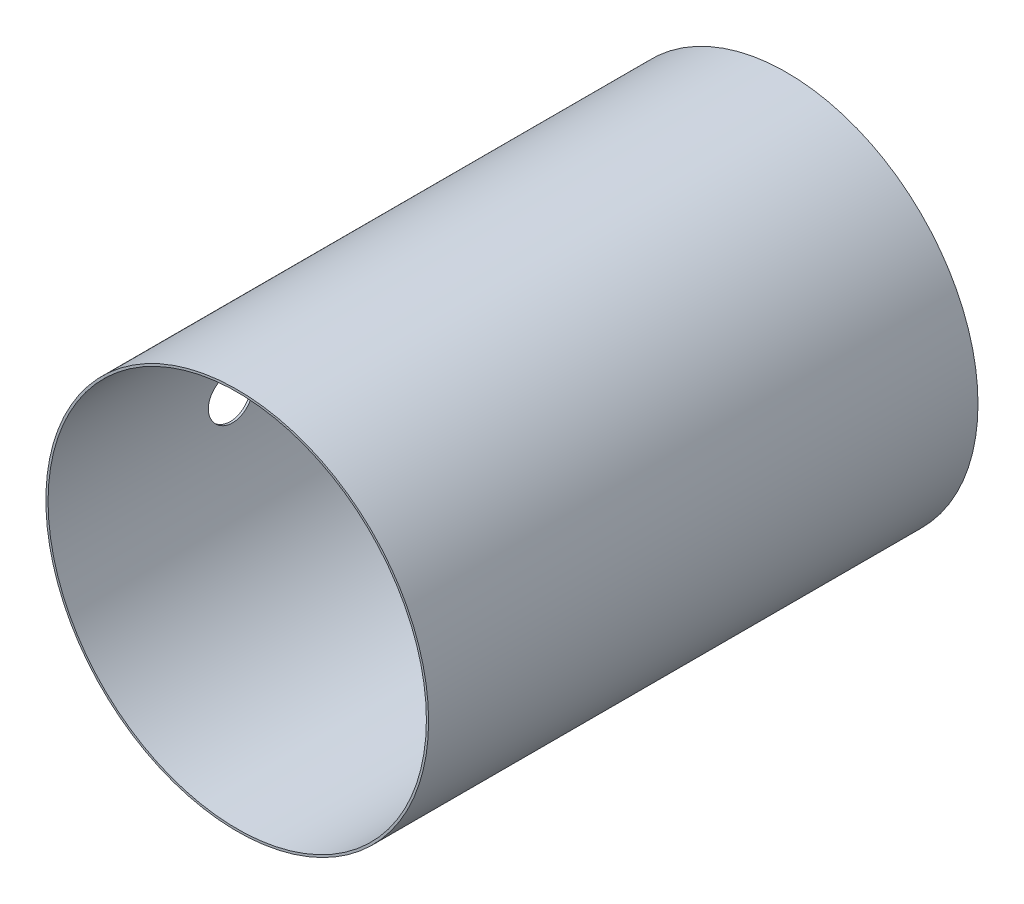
from build123d import *

# Parameters (mm, degrees)
ESQUISSE1_R             = 522.5
ESQUISSE1_R_2           = 516.5
BASE_EXTRUSION_DEPTH    = 1500
ESQUISSE2_R             = 62.5
ESQUISSE2_R_2           = 82.5
ENL_V_MAT_EXTRU_1_DEPTH = 1673.128135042


with BuildPart() as part:
    # Esquisse1 → Base-Extrusion (new body)
    with BuildSketch(Plane.XY):
        Circle(ESQUISSE1_R)
        Circle(ESQUISSE1_R_2, mode=Mode.SUBTRACT)
    extrude(amount=BASE_EXTRUSION_DEPTH)

    # Esquisse2 → Enl_v. mat.-Extru.1 (cut, through all)
    with BuildSketch(Plane(origin=(0, 0, 0), x_dir=(0, 0, -1), z_dir=(1, 0, 0))):
        with Locations((-1000, 0)):
            Circle(ESQUISSE2_R)
        with Locations((-290, 0)):
            Circle(ESQUISSE2_R_2)
    extrude(amount=-ENL_V_MAT_EXTRU_1_DEPTH, mode=Mode.SUBTRACT)


solid = part.part
